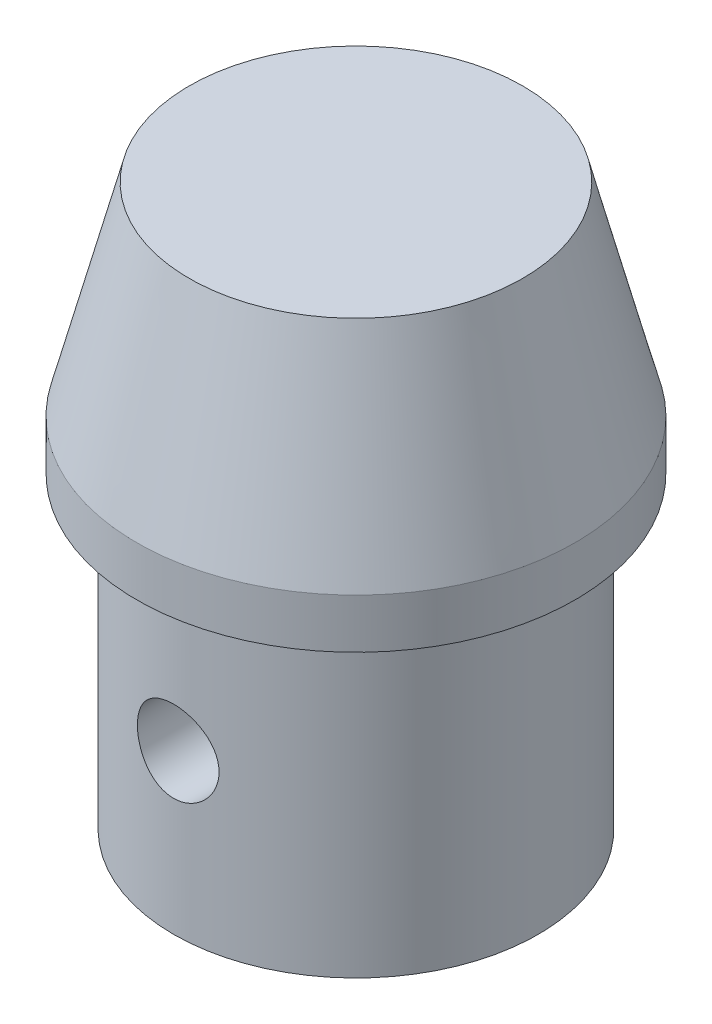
from build123d import *

# Parameters (mm, degrees)
SKETCH2_R          = 1.63195
CUT_EXTRUDE1_DEPTH = 20.32


with BuildPart() as part:
    # Sketch1 → Revolve1 (revolve)
    with BuildSketch(Plane.XY, mode=Mode.PRIVATE) as revolve1_sk:
        Polygon((0, 0), (7.2898, 0), (7.2898, 12.319), (8.763, 12.319), (8.763, 14.3002), (6.6675, 22.4028), (0, 22.4028), align=None)
    revolve(revolve1_sk.sketch.rotate(Axis((0, 0, 0), (0, 1, 0)), 90), axis=Axis((0, 0, 0), (0, 1, 0)))

    # Sketch2 → Cut-Extrude1 (cut, symmetric)
    with BuildSketch(Plane.XY):
        with Locations((0, 6.34365)):
            Circle(SKETCH2_R)
    extrude(amount=CUT_EXTRUDE1_DEPTH, both=True, mode=Mode.SUBTRACT)


solid = part.part
